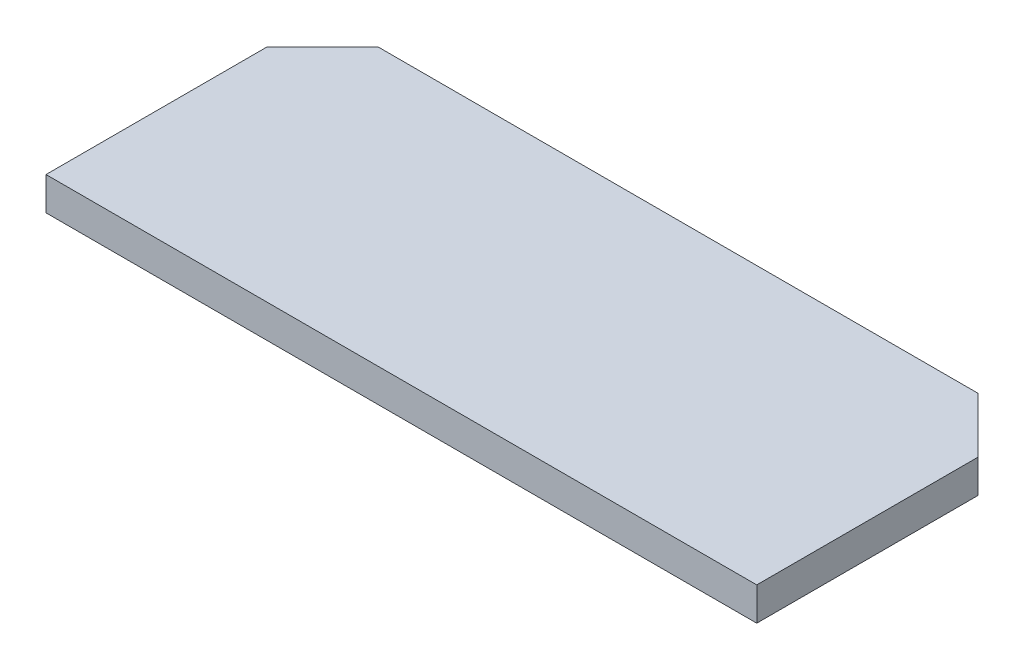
from build123d import *

# Parameters (mm, degrees)
SZKIC1_W                    = 257
SZKIC1_H                    = 100
DODANIE_WYCI_GNI_CIE1_DEPTH = 12
SFAZOWANIE1_SIZE            = 20


with BuildPart() as part:
    # Szkic1 → Dodanie-wyci_gni_cie1 (new body)
    with BuildSketch(Plane(origin=(0, 0, 0), x_dir=(1, 0, 0), z_dir=(0, 1, 0))):
        with Locations((128.5, -50)):
            Rectangle(SZKIC1_W, SZKIC1_H)
    extrude(amount=DODANIE_WYCI_GNI_CIE1_DEPTH)

    # Sfazowanie1
    sfazowanie1_edges = [part.edges().sort_by_distance(p)[0] for p in [
        (0, 6, 0),
        (257, 6, 0),
    ]]
    chamfer(sfazowanie1_edges, length=SFAZOWANIE1_SIZE)


solid = part.part
